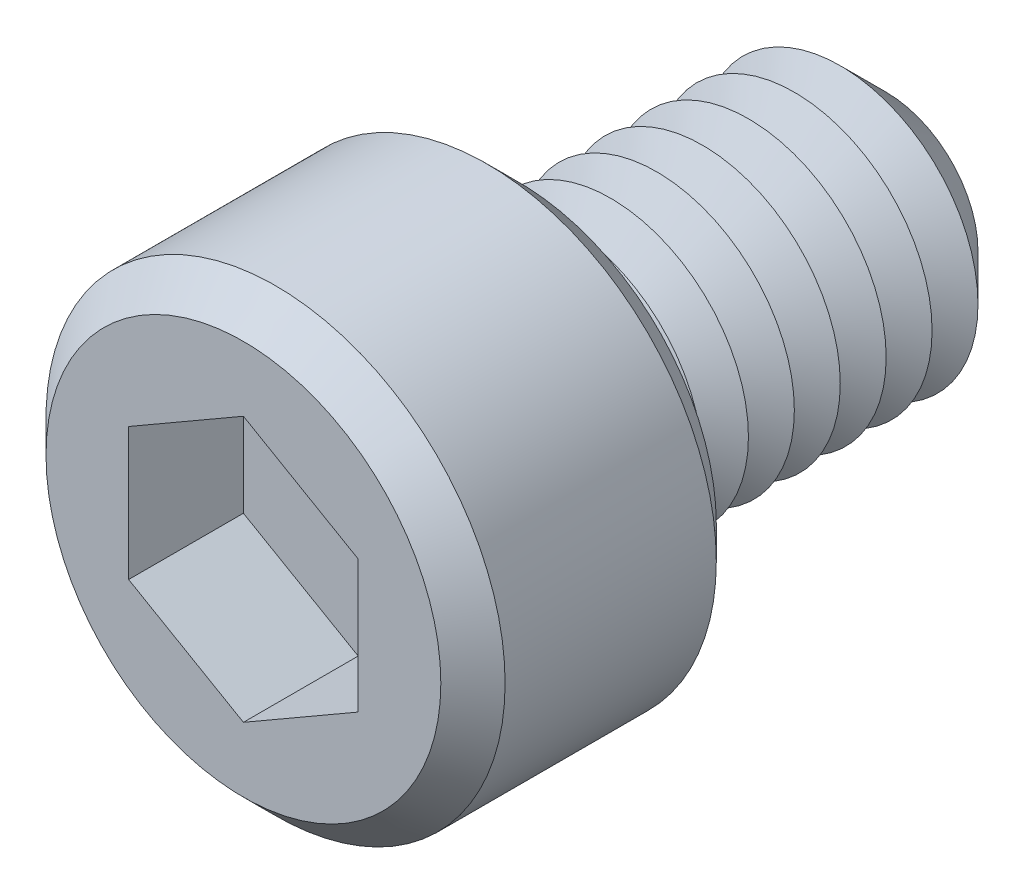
from build123d import *

# Parameters (mm, degrees)
SKETCH1_R           = 5
BOSS_EXTRUDE1_DEPTH = 6
SKETCH2_R           = 3
BOSS_EXTRUDE2_DEPTH = 8
CHAMFER1_SIZE       = 1
LPATTERN1_COUNT     = 7
LPATTERN1_PITCH     = 1
CUT_EXTRUDE1_DEPTH  = 2.5
SKETCH6_R           = 0.8
CUT_EXTRUDE2_DEPTH  = 11.5
CHAMFER2_SIZE       = 0.7


with BuildPart() as part:
    # Sketch1 → Boss-Extrude1 (new body)
    with BuildSketch(Plane.XY):
        Circle(SKETCH1_R)
    extrude(amount=BOSS_EXTRUDE1_DEPTH)

    # Sketch2 → Boss-Extrude2 (add)
    with BuildSketch(Plane(origin=(0, 0, 0), x_dir=(-1, 0, 0), z_dir=(0, 0, -1))):
        Circle(SKETCH2_R)
    extrude(amount=BOSS_EXTRUDE2_DEPTH)

    # Chamfer1
    chamfer1_edges = [part.edges().sort_by_distance(p)[0] for p in [
        (3, 0, -8),
    ]]
    chamfer(chamfer1_edges, length=CHAMFER1_SIZE)

    # Sketch4 → Cut-Revolve1 (revolve, cut)
    with BuildSketch(Plane(origin=(0, 0, 0), x_dir=(0, 0, -1), z_dir=(1, 0, 0)), mode=Mode.PRIVATE) as cut_revolve1_sk:
        Polygon((0, 3), (0.5, 2.133974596), (1, 3), align=None)
    cut_revolve1 = revolve(cut_revolve1_sk.sketch.rotate(Axis((0, 0, 2.512122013), (0, 0, -1)), 90), axis=Axis((0, 0, 2.512122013), (0, 0, -1)), mode=Mode.SUBTRACT)

    # LPattern1: Cut-Revolve1 ×7
    with Locations(*[(0, 0, -i * LPATTERN1_PITCH) for i in range(1, LPATTERN1_COUNT)]):
        add(cut_revolve1, mode=Mode.SUBTRACT)

    # Sketch5 → Cut-Extrude1 (cut)
    with BuildSketch(Plane.XY.offset(6)):
        Polygon((0, 2.886751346), (-2.5, 1.443375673), (-2.5, -1.443375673), (0, -2.886751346), (2.5, -1.443375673), (2.5, 1.443375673), align=None)
    extrude(amount=-CUT_EXTRUDE1_DEPTH, mode=Mode.SUBTRACT)

    # Sketch6 → Cut-Extrude2 (cut)
    with BuildSketch(Plane.XY.offset(3.5)):
        Circle(SKETCH6_R)
    extrude(amount=-CUT_EXTRUDE2_DEPTH, mode=Mode.SUBTRACT)

    # Chamfer2
    chamfer2_edges = [part.edges().sort_by_distance(p)[0] for p in [
        (-5, 0, 0),
        (-5, 0, 6),
    ]]
    chamfer(chamfer2_edges, length=CHAMFER2_SIZE)


solid = part.part
